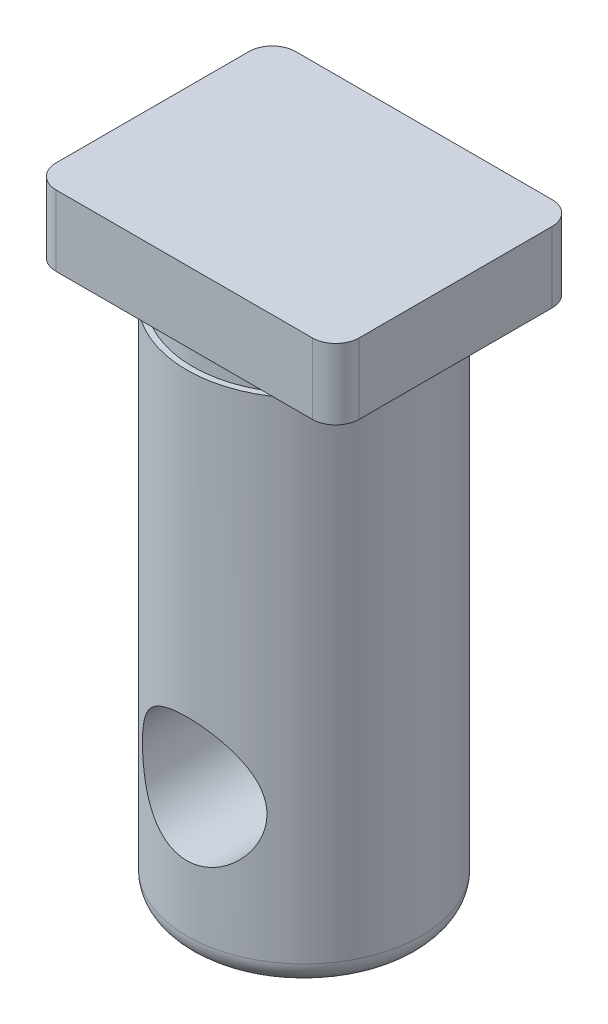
from build123d import *

# Parameters (mm, degrees)
SKETCH1_R           = 3.94335
BOSS_EXTRUDE1_DEPTH = 20.4216
CUT_EXTRUDE1_START  = -3.1369
SKETCH2_R           = 3.94335
SKETCH2_R_2         = 3.7465
CUT_EXTRUDE1_DEPTH  = 3.1369
BOSS_EXTRUDE2_DEPTH = 2.3749
SKETCH4_R           = 2.0955
CUT_EXTRUDE2_DEPTH  = 17.6149
FILLET1_R           = 0.7874


with BuildPart() as part:
    # Sketch1 → Boss-Extrude1 (new body)
    with BuildSketch(Plane(origin=(0, 0, 0), x_dir=(1, 0, 0), z_dir=(0, 1, 0))):
        with Locations(Location((0, 0, 0), (0, 0, 270))):
            Circle(SKETCH1_R)
    extrude(amount=BOSS_EXTRUDE1_DEPTH)

    # Sketch2 → Cut-Extrude1 (cut)
    with BuildSketch(Plane(origin=(0, 20.4216, 0), x_dir=(1, 0, 0), z_dir=(0, 1, 0)).offset(CUT_EXTRUDE1_START)):
        with Locations(Location((0, 0, 0), (0, 0, 270))):
            Circle(SKETCH2_R)
        with Locations(Location((0, 0, 0), (0, 0, 270))):
            Circle(SKETCH2_R_2, mode=Mode.SUBTRACT)
    extrude(amount=CUT_EXTRUDE1_DEPTH, mode=Mode.SUBTRACT)

    # Sketch3 → Boss-Extrude2 (add)
    with BuildSketch(Plane(origin=(0, 20.4216, 0), x_dir=(1, 0, 0), z_dir=(0, 1, 0))):
        with BuildLine():
            Line((-4.312666, 4.03225), (4.312666, 4.03225))
            ThreePointArc((4.312666, 4.03225), (4.86944188, 3.80162588), (5.100066, 3.24485))
            Line((5.100066, 3.24485), (5.100066, -3.24485))
            ThreePointArc((5.100066, -3.24485), (4.86944188, -3.80162588), (4.312666, -4.03225))
            Line((4.312666, -4.03225), (-4.312666, -4.03225))
            ThreePointArc((-4.312666, -4.03225), (-4.86944188, -3.80162588), (-5.100066, -3.24485))
            Line((-5.100066, -3.24485), (-5.100066, 3.24485))
            ThreePointArc((-5.100066, 3.24485), (-4.86944188, 3.80162588), (-4.312666, 4.03225))
        make_face()
    extrude(amount=-BOSS_EXTRUDE2_DEPTH)

    # Sketch4 → Cut-Extrude2 (cut)
    with BuildSketch(Plane.XY.offset(4.03225)):
        with Locations(Location((0, 5.08, 0), (0, 0, 89.999999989))):
            Circle(SKETCH4_R)
    extrude(amount=-CUT_EXTRUDE2_DEPTH, mode=Mode.SUBTRACT)

    # Fillet1
    fillet1_edges = [part.edges().sort_by_distance(p)[0] for p in [
        (0, 0, -3.94335),
    ]]
    fillet(fillet1_edges, radius=FILLET1_R)


solid = part.part
